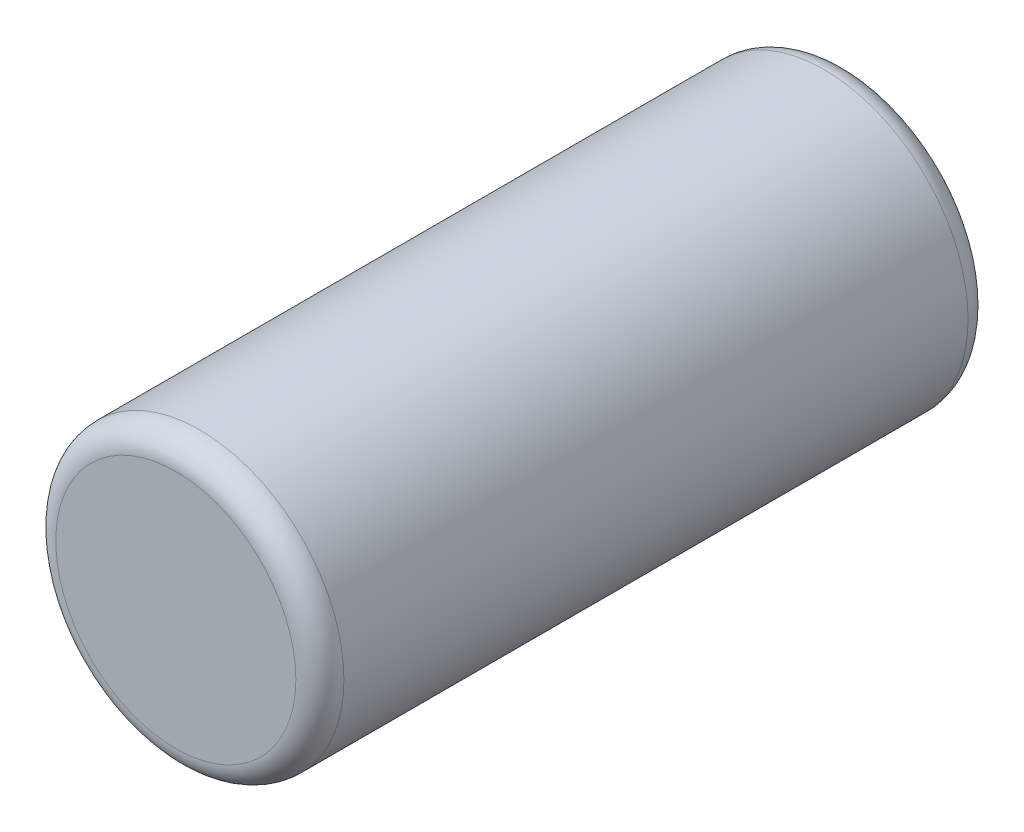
ISO-10303-21;
HEADER;
FILE_DESCRIPTION(('STEP AP214'),'2;1');
FILE_NAME('part.step','',(''),(''),'','','');
FILE_SCHEMA(('AUTOMOTIVE_DESIGN { 1 0 10303 214 1 1 1 1 }'));
ENDSEC;
DATA;
#1=APPLICATION_CONTEXT('core data for automotive mechanical design processes');
#2=APPLICATION_PROTOCOL_DEFINITION('international standard','automotive_design',2000,#1);
#3=PRODUCT_CONTEXT('',#1,'mechanical');
#4=PRODUCT('Part','Part','',(#3));
#5=PRODUCT_RELATED_PRODUCT_CATEGORY('part','',(#4));
#6=PRODUCT_DEFINITION_FORMATION('','',#4);
#7=PRODUCT_DEFINITION_CONTEXT('part definition',#1,'design');
#8=PRODUCT_DEFINITION('design','',#6,#7);
#9=PRODUCT_DEFINITION_SHAPE('','',#8);
#10=(LENGTH_UNIT() NAMED_UNIT(*) SI_UNIT(.MILLI.,.METRE.));
#11=(NAMED_UNIT(*) PLANE_ANGLE_UNIT() SI_UNIT($,.RADIAN.));
#12=(NAMED_UNIT(*) SI_UNIT($,.STERADIAN.) SOLID_ANGLE_UNIT());
#13=UNCERTAINTY_MEASURE_WITH_UNIT(LENGTH_MEASURE(1.E-05),#10,'distance_accuracy_value','');
#14=(GEOMETRIC_REPRESENTATION_CONTEXT(3) GLOBAL_UNCERTAINTY_ASSIGNED_CONTEXT((#13)) GLOBAL_UNIT_ASSIGNED_CONTEXT((#10,
#11,#12)) REPRESENTATION_CONTEXT('',''));
#15=CARTESIAN_POINT('',(0.,0.,0.));
#16=DIRECTION('',(0.,0.,1.));
#17=DIRECTION('',(1.,0.,0.));
#18=AXIS2_PLACEMENT_3D('',#15,#16,#17);
#19=CARTESIAN_POINT('',(0.,0.,7.));
#20=DIRECTION('',(0.,0.,-1.));
#21=DIRECTION('',(-1.,0.,0.));
#22=AXIS2_PLACEMENT_3D('',#19,#20,#21);
#23=CYLINDRICAL_SURFACE('',#22,3.);
#24=CARTESIAN_POINT('',(0.,0.,-6.5));
#25=DIRECTION('',(0.,0.,1.));
#26=DIRECTION('',(1.,0.,0.));
#27=AXIS2_PLACEMENT_3D('',#24,#25,#26);
#28=CIRCLE('',#27,3.);
#29=CARTESIAN_POINT('',(3.,0.,-6.5));
#30=VERTEX_POINT('',#29);
#31=EDGE_CURVE('E40',#30,#30,#28,.T.);
#32=ORIENTED_EDGE('',*,*,#31,.T.);
#33=EDGE_LOOP('',(#32));
#34=FACE_BOUND('',#33,.T.);
#35=CARTESIAN_POINT('',(0.,0.,6.5));
#36=DIRECTION('',(0.,0.,1.));
#37=DIRECTION('',(1.,0.,0.));
#38=AXIS2_PLACEMENT_3D('',#35,#36,#37);
#39=CIRCLE('',#38,3.);
#40=CARTESIAN_POINT('',(3.,0.,6.5));
#41=VERTEX_POINT('',#40);
#42=EDGE_CURVE('E44',#41,#41,#39,.F.);
#43=ORIENTED_EDGE('',*,*,#42,.T.);
#44=EDGE_LOOP('',(#43));
#45=FACE_BOUND('',#44,.T.);
#46=ADVANCED_FACE('F29',(#34,#45),#23,.T.);
#47=CARTESIAN_POINT('',(0.,0.,7.));
#48=DIRECTION('',(0.,0.,1.));
#49=DIRECTION('',(1.,0.,0.));
#50=AXIS2_PLACEMENT_3D('',#47,#48,#49);
#51=PLANE('',#50);
#52=CARTESIAN_POINT('',(0.,0.,7.));
#53=DIRECTION('',(0.,0.,1.));
#54=DIRECTION('',(1.,0.,0.));
#55=AXIS2_PLACEMENT_3D('',#52,#53,#54);
#56=CIRCLE('',#55,2.5);
#57=CARTESIAN_POINT('',(2.5,0.,7.));
#58=VERTEX_POINT('',#57);
#59=EDGE_CURVE('E10',#58,#58,#56,.T.);
#60=ORIENTED_EDGE('',*,*,#59,.T.);
#61=EDGE_LOOP('',(#60));
#62=FACE_BOUND('',#61,.T.);
#63=ADVANCED_FACE('F60',(#62),#51,.T.);
#64=CARTESIAN_POINT('',(0.,0.,-7.));
#65=DIRECTION('',(0.,0.,1.));
#66=DIRECTION('',(1.,0.,0.));
#67=AXIS2_PLACEMENT_3D('',#64,#65,#66);
#68=PLANE('',#67);
#69=CARTESIAN_POINT('',(0.,0.,-7.));
#70=DIRECTION('',(0.,0.,1.));
#71=DIRECTION('',(1.,0.,0.));
#72=AXIS2_PLACEMENT_3D('',#69,#70,#71);
#73=CIRCLE('',#72,2.5);
#74=CARTESIAN_POINT('',(2.5,0.,-7.));
#75=VERTEX_POINT('',#74);
#76=EDGE_CURVE('E36',#75,#75,#73,.F.);
#77=ORIENTED_EDGE('',*,*,#76,.T.);
#78=EDGE_LOOP('',(#77));
#79=FACE_BOUND('',#78,.T.);
#80=ADVANCED_FACE('F57',(#79),#68,.F.);
#81=CARTESIAN_POINT('',(0.,0.,-6.5));
#82=DIRECTION('',(0.,0.,1.));
#83=DIRECTION('',(1.,0.,0.));
#84=AXIS2_PLACEMENT_3D('',#81,#82,#83);
#85=TOROIDAL_SURFACE('',#84,2.5,0.5);
#86=ORIENTED_EDGE('',*,*,#76,.F.);
#87=EDGE_LOOP('',(#86));
#88=FACE_BOUND('',#87,.T.);
#89=ORIENTED_EDGE('',*,*,#31,.F.);
#90=EDGE_LOOP('',(#89));
#91=FACE_BOUND('',#90,.T.);
#92=ADVANCED_FACE('F53',(#88,#91),#85,.T.);
#93=CARTESIAN_POINT('',(0.,0.,6.5));
#94=DIRECTION('',(0.,0.,1.));
#95=DIRECTION('',(1.,0.,0.));
#96=AXIS2_PLACEMENT_3D('',#93,#94,#95);
#97=TOROIDAL_SURFACE('',#96,2.5,0.5);
#98=ORIENTED_EDGE('',*,*,#42,.F.);
#99=EDGE_LOOP('',(#98));
#100=FACE_BOUND('',#99,.T.);
#101=ORIENTED_EDGE('',*,*,#59,.F.);
#102=EDGE_LOOP('',(#101));
#103=FACE_BOUND('',#102,.T.);
#104=ADVANCED_FACE('F31',(#100,#103),#97,.T.);
#105=CLOSED_SHELL('',(#46,#63,#80,#92,#104));
#106=MANIFOLD_SOLID_BREP('B2',#105);
#107=ADVANCED_BREP_SHAPE_REPRESENTATION('',(#18,#106),#14);
#108=SHAPE_DEFINITION_REPRESENTATION(#9,#107);
ENDSEC;
END-ISO-10303-21;
